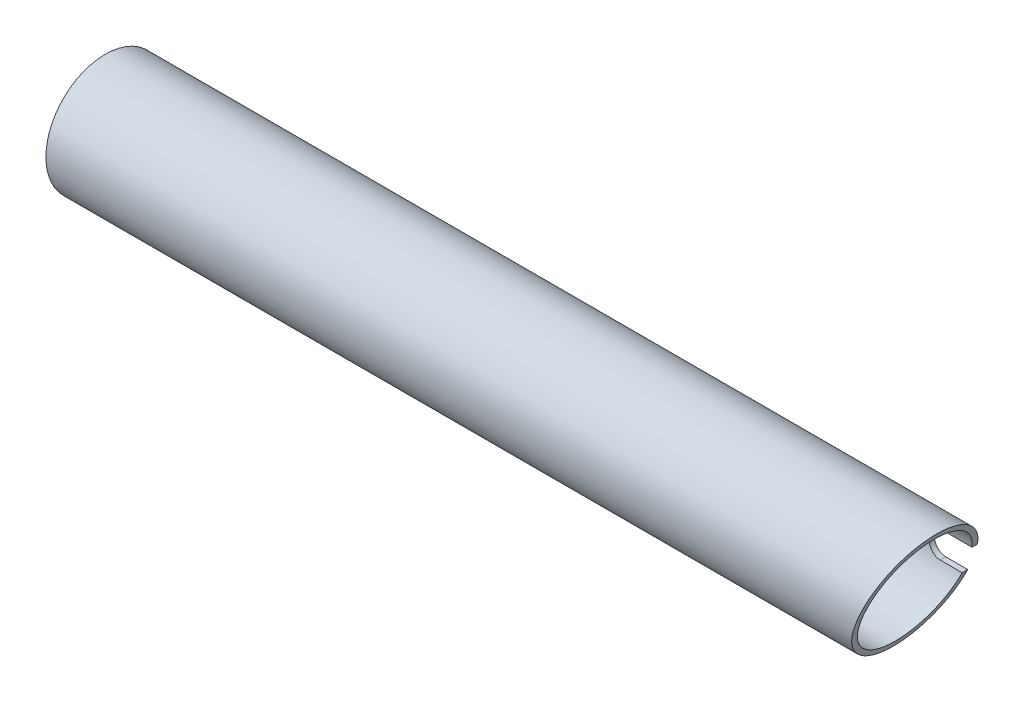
ISO-10303-21;
HEADER;
FILE_DESCRIPTION(('STEP AP214'),'2;1');
FILE_NAME('part.step','',(''),(''),'','','');
FILE_SCHEMA(('AUTOMOTIVE_DESIGN { 1 0 10303 214 1 1 1 1 }'));
ENDSEC;
DATA;
#1=APPLICATION_CONTEXT('core data for automotive mechanical design processes');
#2=APPLICATION_PROTOCOL_DEFINITION('international standard','automotive_design',2000,#1);
#3=PRODUCT_CONTEXT('',#1,'mechanical');
#4=PRODUCT('Part','Part','',(#3));
#5=PRODUCT_RELATED_PRODUCT_CATEGORY('part','',(#4));
#6=PRODUCT_DEFINITION_FORMATION('','',#4);
#7=PRODUCT_DEFINITION_CONTEXT('part definition',#1,'design');
#8=PRODUCT_DEFINITION('design','',#6,#7);
#9=PRODUCT_DEFINITION_SHAPE('','',#8);
#10=(LENGTH_UNIT() NAMED_UNIT(*) SI_UNIT(.MILLI.,.METRE.));
#11=(NAMED_UNIT(*) PLANE_ANGLE_UNIT() SI_UNIT($,.RADIAN.));
#12=(NAMED_UNIT(*) SI_UNIT($,.STERADIAN.) SOLID_ANGLE_UNIT());
#13=UNCERTAINTY_MEASURE_WITH_UNIT(LENGTH_MEASURE(1.E-05),#10,'distance_accuracy_value','');
#14=(GEOMETRIC_REPRESENTATION_CONTEXT(3) GLOBAL_UNCERTAINTY_ASSIGNED_CONTEXT((#13)) GLOBAL_UNIT_ASSIGNED_CONTEXT((#10,
#11,#12)) REPRESENTATION_CONTEXT('',''));
#15=CARTESIAN_POINT('',(0.,0.,0.));
#16=DIRECTION('',(0.,0.,1.));
#17=DIRECTION('',(1.,0.,0.));
#18=AXIS2_PLACEMENT_3D('',#15,#16,#17);
#19=CARTESIAN_POINT('',(160.,0.,0.));
#20=DIRECTION('',(-1.,0.,0.));
#21=DIRECTION('',(0.,0.,1.));
#22=AXIS2_PLACEMENT_3D('',#19,#20,#21);
#23=CYLINDRICAL_SURFACE('',#22,11.);
#24=CARTESIAN_POINT('',(0.,0.,0.));
#25=DIRECTION('',(1.,0.,0.));
#26=DIRECTION('',(0.,0.,-1.));
#27=AXIS2_PLACEMENT_3D('',#24,#25,#26);
#28=CIRCLE('',#27,11.);
#29=CARTESIAN_POINT('',(0.,0.,-11.));
#30=VERTEX_POINT('',#29);
#31=EDGE_CURVE('E91',#30,#30,#28,.T.);
#32=ORIENTED_EDGE('',*,*,#31,.T.);
#33=EDGE_LOOP('',(#32));
#34=FACE_BOUND('',#33,.T.);
#35=DIRECTION('',(-1.,0.,0.));
#36=VECTOR('',#35,1.);
#37=CARTESIAN_POINT('',(160.,2.50000000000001,-10.7121426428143));
#38=LINE('',#37,#36);
#39=CARTESIAN_POINT('',(150.909925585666,2.5,-10.7121426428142));
#40=VERTEX_POINT('',#39);
#41=CARTESIAN_POINT('',(145.,2.5,-10.7121426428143));
#42=VERTEX_POINT('',#41);
#43=EDGE_CURVE('E58',#40,#42,#38,.T.);
#44=ORIENTED_EDGE('',*,*,#43,.T.);
#45=CARTESIAN_POINT('',(145.,2.5,-10.7121426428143));
#46=CARTESIAN_POINT('',(144.930656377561,2.50000778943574,-10.7121357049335));
#47=CARTESIAN_POINT('',(144.861317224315,2.49711498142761,-10.7128158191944));
#48=CARTESIAN_POINT('',(144.723153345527,2.4855886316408,-10.7154987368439));
#49=CARTESIAN_POINT('',(144.654328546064,2.4769559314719,-10.7175013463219));
#50=CARTESIAN_POINT('',(144.517798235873,2.45403037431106,-10.7227732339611));
#51=CARTESIAN_POINT('',(144.450090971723,2.43974748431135,-10.7260402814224));
#52=CARTESIAN_POINT('',(144.316170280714,2.40565123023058,-10.7337386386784));
#53=CARTESIAN_POINT('',(144.249956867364,2.38583781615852,-10.7381699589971));
#54=CARTESIAN_POINT('',(144.054249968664,2.3183092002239,-10.7530273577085));
#55=CARTESIAN_POINT('',(143.927566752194,2.2624847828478,-10.765021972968));
#56=CARTESIAN_POINT('',(143.68540296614,2.1309292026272,-10.7918310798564));
#57=CARTESIAN_POINT('',(143.569924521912,2.05519427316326,-10.8066461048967));
#58=CARTESIAN_POINT('',(143.351294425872,1.88448995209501,-10.8377270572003));
#59=CARTESIAN_POINT('',(143.248373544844,1.78922803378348,-10.8540126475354));
#60=CARTESIAN_POINT('',(143.059822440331,1.58280149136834,-10.8860291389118));
#61=CARTESIAN_POINT('',(142.974194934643,1.47163437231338,-10.9017599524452));
#62=CARTESIAN_POINT('',(142.821735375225,1.23498721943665,-10.9311097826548));
#63=CARTESIAN_POINT('',(142.755128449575,1.1093586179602,-10.9447027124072));
#64=CARTESIAN_POINT('',(142.644064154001,0.84833678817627,-10.9680202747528));
#65=CARTESIAN_POINT('',(142.599602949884,0.712945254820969,-10.9777455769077));
#66=CARTESIAN_POINT('',(142.534822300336,0.438657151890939,-10.9920932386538));
#67=CARTESIAN_POINT('',(142.514108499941,0.299858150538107,-10.9967988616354));
#68=CARTESIAN_POINT('',(142.496176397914,0.0206776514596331,-11.000865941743));
#69=CARTESIAN_POINT('',(142.498955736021,-0.119703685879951,-11.000227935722));
#70=CARTESIAN_POINT('',(142.52764078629,-0.395334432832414,-10.9937426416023));
#71=CARTESIAN_POINT('',(142.55312072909,-0.530630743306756,-10.9879912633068));
#72=CARTESIAN_POINT('',(142.625803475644,-0.794974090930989,-10.9720354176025));
#73=CARTESIAN_POINT('',(142.673007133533,-0.924020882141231,-10.9618307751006));
#74=CARTESIAN_POINT('',(142.788166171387,-1.17337116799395,-10.9379625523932));
#75=CARTESIAN_POINT('',(142.856280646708,-1.29359855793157,-10.9242725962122));
#76=CARTESIAN_POINT('',(143.011207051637,-1.52106697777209,-10.8949312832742));
#77=CARTESIAN_POINT('',(143.09802120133,-1.62830646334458,-10.879279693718));
#78=CARTESIAN_POINT('',(143.290179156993,-1.82928124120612,-10.8473190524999));
#79=CARTESIAN_POINT('',(143.395893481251,-1.92266146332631,-10.8310031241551));
#80=CARTESIAN_POINT('',(143.621683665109,-2.09046125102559,-10.7998740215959));
#81=CARTESIAN_POINT('',(143.74176343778,-2.16487563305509,-10.7850612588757));
#82=CARTESIAN_POINT('',(143.993500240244,-2.29281096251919,-10.7585928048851));
#83=CARTESIAN_POINT('',(144.125201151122,-2.34624817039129,-10.7469498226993));
#84=CARTESIAN_POINT('',(144.395960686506,-2.43005142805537,-10.7283141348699));
#85=CARTESIAN_POINT('',(144.535008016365,-2.46045185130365,-10.7213145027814));
#86=CARTESIAN_POINT('',(144.729346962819,-2.48590221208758,-10.7154245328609));
#87=CARTESIAN_POINT('',(144.783381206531,-2.49119027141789,-10.71419544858));
#88=CARTESIAN_POINT('',(144.891601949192,-2.49823495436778,-10.7125550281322));
#89=CARTESIAN_POINT('',(144.945788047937,-2.49999741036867,-10.7121423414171));
#90=CARTESIAN_POINT('',(145.,-2.5,-10.7121426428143));
#91=B_SPLINE_CURVE_WITH_KNOTS('',3,(#45,#46,#47,#48,#49,#50,#51,#52,#53,#54,#55,#56,#57,#58,#59,
#60,#61,#62,#63,#64,#65,#66,#67,#68,#69,#70,#71,#72,#73,#74,#75,#76,#77,#78,#79,#80,#81,#82,#83,
#84,#85,#86,#87,#88,#89,#90),.UNSPECIFIED.,.F.,.F.,(4,2,2,2,2,2,2,2,2,2,2,2,2,2,2,2,2,2,2,2,2,2,
4),(0.,0.207959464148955,0.415888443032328,0.623452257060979,0.831017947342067,1.24577925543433,
1.66061908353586,2.08219920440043,2.50384552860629,2.93029316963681,3.35666695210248,
3.77585276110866,4.19499645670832,4.60644048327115,5.01790068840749,5.43257241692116,
5.84729340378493,6.27127621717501,6.69537478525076,7.12114951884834,7.54628769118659,
7.70911145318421,7.87166563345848),.UNSPECIFIED.);
#92=CARTESIAN_POINT('',(145.,-2.5,-10.7121426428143));
#93=VERTEX_POINT('',#92);
#94=EDGE_CURVE('E103',#42,#93,#91,.T.);
#95=ORIENTED_EDGE('',*,*,#94,.T.);
#96=DIRECTION('',(-1.,0.,0.));
#97=VECTOR('',#96,1.);
#98=CARTESIAN_POINT('',(160.,-2.5,-10.7121426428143));
#99=LINE('',#98,#97);
#100=CARTESIAN_POINT('',(149.090074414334,-2.5,-10.7121426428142));
#101=VERTEX_POINT('',#100);
#102=EDGE_CURVE('E107',#93,#101,#99,.F.);
#103=ORIENTED_EDGE('',*,*,#102,.T.);
#104=CARTESIAN_POINT('',(150.,0.,0.));
#105=DIRECTION('',(0.939692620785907,-0.342020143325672,0.));
#106=DIRECTION('',(-0.342020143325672,-0.939692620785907,0.));
#107=AXIS2_PLACEMENT_3D('',#104,#105,#106);
#108=ELLIPSE('',#107,11.705955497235,11.);
#109=EDGE_CURVE('E102',#40,#101,#108,.T.);
#110=ORIENTED_EDGE('',*,*,#109,.F.);
#111=EDGE_LOOP('',(#44,#95,#103,#110));
#112=FACE_BOUND('',#111,.T.);
#113=ADVANCED_FACE('F38',(#34,#112),#23,.T.);
#114=CARTESIAN_POINT('',(160.,0.,0.));
#115=DIRECTION('',(-1.,0.,0.));
#116=DIRECTION('',(0.,0.,1.));
#117=AXIS2_PLACEMENT_3D('',#114,#115,#116);
#118=CYLINDRICAL_SURFACE('',#117,10.);
#119=DIRECTION('',(-1.,0.,0.));
#120=VECTOR('',#119,1.);
#121=CARTESIAN_POINT('',(160.,-2.5,-9.68245836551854));
#122=LINE('',#121,#120);
#123=CARTESIAN_POINT('',(145.,-2.5,-9.68245836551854));
#124=VERTEX_POINT('',#123);
#125=CARTESIAN_POINT('',(149.090074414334,-2.5,-9.68245836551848));
#126=VERTEX_POINT('',#125);
#127=EDGE_CURVE('E66',#124,#126,#122,.F.);
#128=ORIENTED_EDGE('',*,*,#127,.F.);
#129=CARTESIAN_POINT('',(145.,2.5,-9.68245836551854));
#130=CARTESIAN_POINT('',(144.93086221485,2.5000080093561,-9.68245064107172));
#131=CARTESIAN_POINT('',(144.861729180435,2.49713210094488,-9.68319871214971));
#132=CARTESIAN_POINT('',(144.723980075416,2.4856746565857,-9.68614915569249));
#133=CARTESIAN_POINT('',(144.655363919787,2.477094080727,-9.68835128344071));
#134=CARTESIAN_POINT('',(144.519267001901,2.4543119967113,-9.69414685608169));
#135=CARTESIAN_POINT('',(144.451784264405,2.44012162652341,-9.69773754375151));
#136=CARTESIAN_POINT('',(144.31831118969,2.40625174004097,-9.70619672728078));
#137=CARTESIAN_POINT('',(144.252320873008,2.3865721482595,-9.71106524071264));
#138=CARTESIAN_POINT('',(144.057289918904,2.31951549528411,-9.72738369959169));
#139=CARTESIAN_POINT('',(143.93105255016,2.26409745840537,-9.74055281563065));
#140=CARTESIAN_POINT('',(143.689694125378,2.13353299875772,-9.76997886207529));
#141=CARTESIAN_POINT('',(143.57457606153,2.05838128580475,-9.78623662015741));
#142=CARTESIAN_POINT('',(143.356147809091,1.88871268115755,-9.82040642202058));
#143=CARTESIAN_POINT('',(143.253114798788,1.79384357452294,-9.838344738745));
#144=CARTESIAN_POINT('',(143.06424276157,1.58818904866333,-9.87362764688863));
#145=CARTESIAN_POINT('',(142.978406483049,1.47740109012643,-9.89097214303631));
#146=CARTESIAN_POINT('',(142.825223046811,1.24114235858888,-9.92340454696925));
#147=CARTESIAN_POINT('',(142.758150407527,1.11548838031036,-9.93845761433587));
#148=CARTESIAN_POINT('',(142.64618801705,0.854256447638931,-9.96430865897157));
#149=CARTESIAN_POINT('',(142.601293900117,0.718680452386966,-9.97510747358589));
#150=CARTESIAN_POINT('',(142.535852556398,0.444360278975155,-9.99104749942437));
#151=CARTESIAN_POINT('',(142.514830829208,0.305735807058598,-9.99629882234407));
#152=CARTESIAN_POINT('',(142.496241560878,0.0268319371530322,-10.0009359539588));
#153=CARTESIAN_POINT('',(142.498671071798,-0.113447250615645,-10.0003224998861));
#154=CARTESIAN_POINT('',(142.526574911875,-0.388381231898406,-9.99338093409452));
#155=CARTESIAN_POINT('',(142.551536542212,-0.523091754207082,-9.98717996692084));
#156=CARTESIAN_POINT('',(142.622971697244,-0.7863467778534,-9.96990826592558));
#157=CARTESIAN_POINT('',(142.66944617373,-0.914891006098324,-9.95883731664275));
#158=CARTESIAN_POINT('',(142.78300320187,-1.16351821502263,-9.93287494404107));
#159=CARTESIAN_POINT('',(142.850268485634,-1.28351407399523,-9.91794984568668));
#160=CARTESIAN_POINT('',(143.003357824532,-1.51069157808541,-9.88589863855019));
#161=CARTESIAN_POINT('',(143.089184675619,-1.61787128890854,-9.86877219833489));
#162=CARTESIAN_POINT('',(143.279697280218,-1.81942347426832,-9.83363915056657));
#163=CARTESIAN_POINT('',(143.384829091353,-1.9133727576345,-9.81562126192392));
#164=CARTESIAN_POINT('',(143.609574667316,-2.08242393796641,-9.78115420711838));
#165=CARTESIAN_POINT('',(143.729192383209,-2.15752067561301,-9.76470547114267));
#166=CARTESIAN_POINT('',(143.980363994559,-2.28701177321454,-9.73519533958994));
#167=CARTESIAN_POINT('',(144.111978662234,-2.34129254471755,-9.72215264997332));
#168=CARTESIAN_POINT('',(144.382792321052,-2.42675587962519,-9.70117647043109));
#169=CARTESIAN_POINT('',(144.521979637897,-2.45797297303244,-9.69323534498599));
#170=CARTESIAN_POINT('',(144.718643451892,-2.48476158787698,-9.68638226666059));
#171=CARTESIAN_POINT('',(144.774799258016,-2.49047697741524,-9.68491307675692));
#172=CARTESIAN_POINT('',(144.887294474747,-2.49809189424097,-9.6829515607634));
#173=CARTESIAN_POINT('',(144.943633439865,-2.49999759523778,-9.68245765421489));
#174=CARTESIAN_POINT('',(145.,-2.5,-9.68245836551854));
#175=B_SPLINE_CURVE_WITH_KNOTS('',3,(#129,#130,#131,#132,#133,#134,#135,#136,#137,#138,#139,
#140,#141,#142,#143,#144,#145,#146,#147,#148,#149,#150,#151,#152,#153,#154,#155,#156,#157,#158,
#159,#160,#161,#162,#163,#164,#165,#166,#167,#168,#169,#170,#171,#172,#173,#174),.UNSPECIFIED.,
.F.,.F.,(4,2,2,2,2,2,2,2,2,2,2,2,2,2,2,2,2,2,2,2,2,2,4),(0.,0.207341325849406,0.414647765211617,
0.621544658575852,0.828444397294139,1.24183269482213,1.65533192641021,2.07697423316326,
2.49868387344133,2.92627416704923,3.35378025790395,3.77263152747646,4.19143014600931,
4.60093312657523,5.01045422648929,5.42368222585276,5.83697251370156,6.2614052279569,
6.68595396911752,7.11278749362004,7.53898067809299,7.70826570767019,7.87727618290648),.UNSPECIFIED.);
#176=CARTESIAN_POINT('',(145.,2.5,-9.68245836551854));
#177=VERTEX_POINT('',#176);
#178=EDGE_CURVE('E12',#177,#124,#175,.T.);
#179=ORIENTED_EDGE('',*,*,#178,.F.);
#180=DIRECTION('',(-1.,0.,0.));
#181=VECTOR('',#180,1.);
#182=CARTESIAN_POINT('',(160.,2.50000000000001,-9.68245836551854));
#183=LINE('',#182,#181);
#184=CARTESIAN_POINT('',(150.909925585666,2.5,-9.68245836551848));
#185=VERTEX_POINT('',#184);
#186=EDGE_CURVE('E85',#185,#177,#183,.T.);
#187=ORIENTED_EDGE('',*,*,#186,.F.);
#188=CARTESIAN_POINT('',(150.,0.,0.));
#189=DIRECTION('',(0.939692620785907,-0.342020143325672,0.));
#190=DIRECTION('',(-0.342020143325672,-0.939692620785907,0.));
#191=AXIS2_PLACEMENT_3D('',#188,#189,#190);
#192=ELLIPSE('',#191,10.6417777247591,10.);
#193=EDGE_CURVE('E98',#185,#126,#192,.T.);
#194=ORIENTED_EDGE('',*,*,#193,.T.);
#195=EDGE_LOOP('',(#128,#179,#187,#194));
#196=FACE_BOUND('',#195,.T.);
#197=CARTESIAN_POINT('',(0.,0.,0.));
#198=DIRECTION('',(1.,0.,0.));
#199=DIRECTION('',(0.,0.,-1.));
#200=AXIS2_PLACEMENT_3D('',#197,#198,#199);
#201=CIRCLE('',#200,10.);
#202=CARTESIAN_POINT('',(0.,0.,-10.));
#203=VERTEX_POINT('',#202);
#204=EDGE_CURVE('E105',#203,#203,#201,.T.);
#205=ORIENTED_EDGE('',*,*,#204,.F.);
#206=EDGE_LOOP('',(#205));
#207=FACE_BOUND('',#206,.T.);
#208=ADVANCED_FACE('F96',(#196,#207),#118,.F.);
#209=CARTESIAN_POINT('',(0.,0.,0.));
#210=DIRECTION('',(1.,0.,0.));
#211=DIRECTION('',(0.,0.,-1.));
#212=AXIS2_PLACEMENT_3D('',#209,#210,#211);
#213=PLANE('',#212);
#214=ORIENTED_EDGE('',*,*,#31,.F.);
#215=EDGE_LOOP('',(#214));
#216=FACE_BOUND('',#215,.T.);
#217=ORIENTED_EDGE('',*,*,#204,.T.);
#218=EDGE_LOOP('',(#217));
#219=FACE_BOUND('',#218,.T.);
#220=ADVANCED_FACE('F132',(#216,#219),#213,.F.);
#221=CARTESIAN_POINT('',(154.003672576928,11.,217.496165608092));
#222=DIRECTION('',(0.939692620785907,-0.342020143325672,0.));
#223=DIRECTION('',(0.342020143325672,0.939692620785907,0.));
#224=AXIS2_PLACEMENT_3D('',#221,#222,#223);
#225=PLANE('',#224);
#226=DIRECTION('',(0.,0.,-1.));
#227=VECTOR('',#226,1.);
#228=CARTESIAN_POINT('',(149.090074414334,-2.5,217.496165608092));
#229=LINE('',#228,#227);
#230=EDGE_CURVE('E51',#126,#101,#229,.T.);
#231=ORIENTED_EDGE('',*,*,#230,.F.);
#232=ORIENTED_EDGE('',*,*,#193,.F.);
#233=DIRECTION('',(0.,0.,1.));
#234=VECTOR('',#233,1.);
#235=CARTESIAN_POINT('',(150.909925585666,2.5,217.496165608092));
#236=LINE('',#235,#234);
#237=EDGE_CURVE('E82',#40,#185,#236,.T.);
#238=ORIENTED_EDGE('',*,*,#237,.F.);
#239=ORIENTED_EDGE('',*,*,#109,.T.);
#240=EDGE_LOOP('',(#231,#232,#238,#239));
#241=FACE_BOUND('',#240,.T.);
#242=ADVANCED_FACE('F101',(#241),#225,.T.);
#243=CARTESIAN_POINT('',(145.,0.,-11.));
#244=DIRECTION('',(0.,0.,1.));
#245=DIRECTION('',(1.,0.,0.));
#246=AXIS2_PLACEMENT_3D('',#243,#244,#245);
#247=CYLINDRICAL_SURFACE('',#246,2.5);
#248=DIRECTION('',(0.,0.,1.));
#249=VECTOR('',#248,1.);
#250=CARTESIAN_POINT('',(145.,2.5,-11.));
#251=LINE('',#250,#249);
#252=EDGE_CURVE('E187',#42,#177,#251,.T.);
#253=ORIENTED_EDGE('',*,*,#252,.T.);
#254=ORIENTED_EDGE('',*,*,#178,.T.);
#255=DIRECTION('',(0.,0.,1.));
#256=VECTOR('',#255,1.);
#257=CARTESIAN_POINT('',(145.,-2.5,-11.));
#258=LINE('',#257,#256);
#259=EDGE_CURVE('E99',#93,#124,#258,.T.);
#260=ORIENTED_EDGE('',*,*,#259,.F.);
#261=ORIENTED_EDGE('',*,*,#94,.F.);
#262=EDGE_LOOP('',(#253,#254,#260,#261));
#263=FACE_BOUND('',#262,.T.);
#264=ADVANCED_FACE('F122',(#263),#247,.F.);
#265=CARTESIAN_POINT('',(145.,-2.5,-11.));
#266=DIRECTION('',(0.,-1.,0.));
#267=DIRECTION('',(0.,0.,-1.));
#268=AXIS2_PLACEMENT_3D('',#265,#266,#267);
#269=PLANE('',#268);
#270=ORIENTED_EDGE('',*,*,#259,.T.);
#271=ORIENTED_EDGE('',*,*,#127,.T.);
#272=ORIENTED_EDGE('',*,*,#230,.T.);
#273=ORIENTED_EDGE('',*,*,#102,.F.);
#274=EDGE_LOOP('',(#270,#271,#272,#273));
#275=FACE_BOUND('',#274,.T.);
#276=ADVANCED_FACE('F113',(#275),#269,.F.);
#277=CARTESIAN_POINT('',(150.909925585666,2.5,-11.));
#278=DIRECTION('',(0.,1.,0.));
#279=DIRECTION('',(-1.,0.,0.));
#280=AXIS2_PLACEMENT_3D('',#277,#278,#279);
#281=PLANE('',#280);
#282=ORIENTED_EDGE('',*,*,#237,.T.);
#283=ORIENTED_EDGE('',*,*,#186,.T.);
#284=ORIENTED_EDGE('',*,*,#252,.F.);
#285=ORIENTED_EDGE('',*,*,#43,.F.);
#286=EDGE_LOOP('',(#282,#283,#284,#285));
#287=FACE_BOUND('',#286,.T.);
#288=ADVANCED_FACE('F84',(#287),#281,.F.);
#289=CLOSED_SHELL('',(#113,#208,#220,#242,#264,#276,#288));
#290=MANIFOLD_SOLID_BREP('B2',#289);
#291=ADVANCED_BREP_SHAPE_REPRESENTATION('',(#18,#290),#14);
#292=SHAPE_DEFINITION_REPRESENTATION(#9,#291);
ENDSEC;
END-ISO-10303-21;
